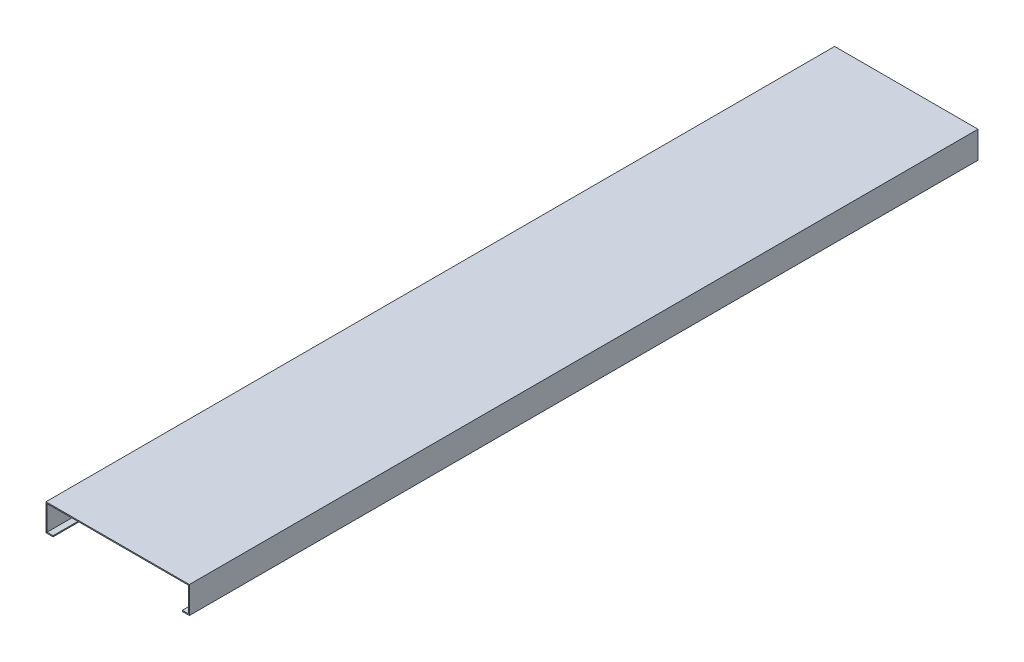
from build123d import *

# Parameters (mm, degrees)
SALIENTE_EXTRUIR1_DEPTH = 1114


with BuildPart() as part:
    # Croquis1 → Saliente-Extruir1 (new body)
    with BuildSketch(Plane.XY):
        Polygon((0, 0), (202.5, 0), (202.5, -38), (192.5, -38), (192.5, -36.5), (201, -36.5), (201, -1.5), (1.5, -1.5), (1.5, -36.5), (10, -36.5), (10, -38), (0, -38), align=None)
    extrude(amount=SALIENTE_EXTRUIR1_DEPTH)


solid = part.part
